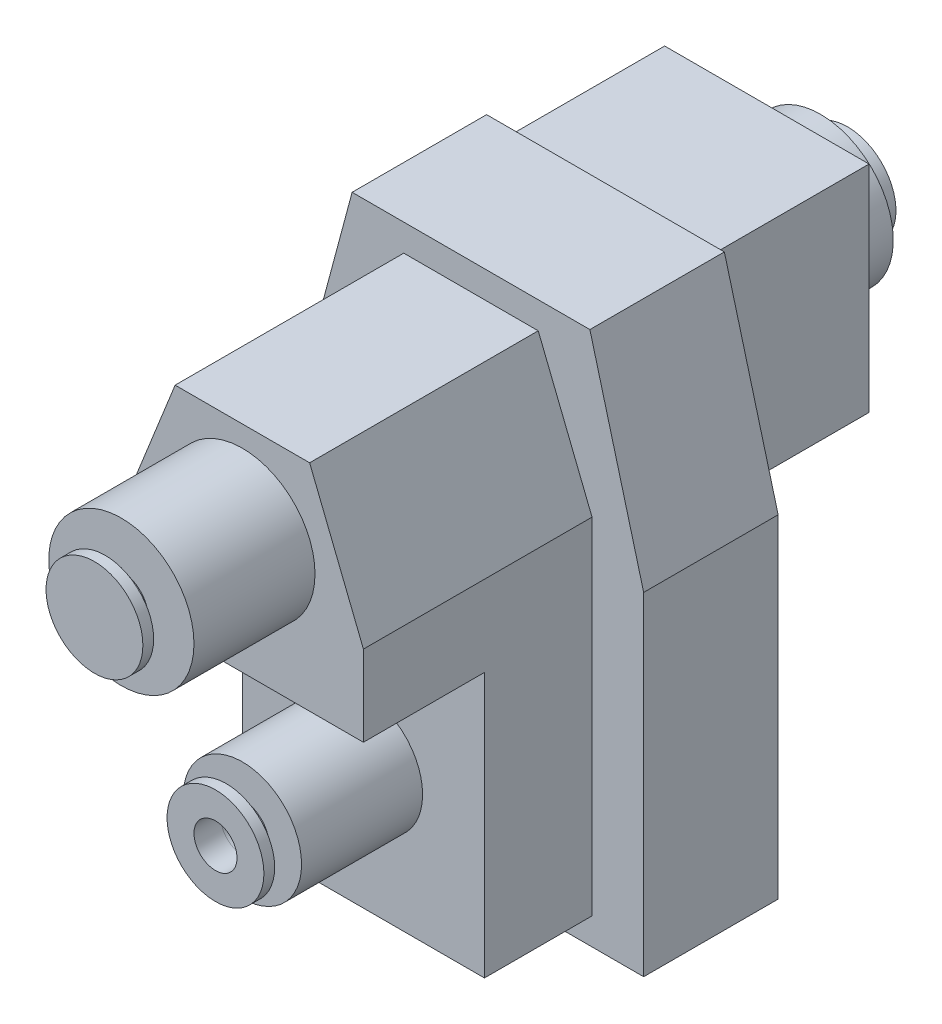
from build123d import *

# Parameters (mm, degrees)
SKETCH1_W            = 642
SKETCH1_H            = 992
BOSS_EXTRUDE1_DEPTH  = 250
CHAMFER1_SIZE        = 100
CHAMFER1_SIZE2       = 373.205080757
BOSS_EXTRUDE2_DEPTH  = 200
BOSS_EXTRUDE3_DEPTH  = 425
BOSS_EXTRUDE4_DEPTH  = 650
SKETCH3_W            = 380
SKETCH3_H            = 400
BOSS_EXTRUDE5_DEPTH  = 300
BOSS_EXTRUDE6_START  = 100
SKETCH4_R            = 135
BOSS_EXTRUDE6_DEPTH  = 100
BOSS_EXTRUDE7_START  = -340
SKETCH2_5_R          = 110
BOSS_EXTRUDE7_DEPTH  = 340
SHELL1_T             = -80
SKETCH5_W            = 642
SKETCH5_H            = 250
BOSS_EXTRUDE8_DEPTH  = 100
SKETCH6_R            = 50
BOSS_EXTRUDE9_DEPTH  = 50
BOSS_EXTRUDE10_START = 50
SKETCH6_3_R          = 90
SKETCH6_3_R_2        = 50
BOSS_EXTRUDE10_DEPTH = 20
BOSS_EXTRUDE11_START = -1300
SKETCH6_4_R          = 50
BOSS_EXTRUDE11_DEPTH = 50
BOSS_EXTRUDE12_START = -1350
SKETCH6_5_R          = 90
SKETCH6_5_R_2        = 50
BOSS_EXTRUDE12_DEPTH = 20
SKETCH7_R            = 50
BOSS_EXTRUDE13_DEPTH = 50
BOSS_EXTRUDE14_START = 50
SKETCH7_3_R          = 90
SKETCH7_3_R_2        = 50
BOSS_EXTRUDE14_DEPTH = 20
BOSS_EXTRUDE15_START = -765
SKETCH7_4_R          = 50
BOSS_EXTRUDE15_DEPTH = 50
BOSS_EXTRUDE16_START = -815
SKETCH7_5_R          = 90
SKETCH7_5_R_2        = 50
BOSS_EXTRUDE16_DEPTH = 20
SKETCH8_R            = 40
CUT_EXTRUDE1_DEPTH   = 125
CUT_EXTRUDE2_START   = -740
SKETCH8_2_R          = 40
CUT_EXTRUDE2_DEPTH   = 125


with BuildPart() as part:
    # Sketch1 → Boss-Extrude1 (new body)
    with BuildSketch(Plane.XY):
        Rectangle(SKETCH1_W, SKETCH1_H)
    extrude(amount=BOSS_EXTRUDE1_DEPTH)

    # Chamfer1
    chamfer1_edges = [part.edges().sort_by_distance(p)[0] for p in [
        (-321, 496, 125),
        (321, 496, 125),
    ]]
    chamfer1_side = [part.faces().sort_by_distance(p)[0] for p in [
        (0, 496, 125),
    ]]
    chamfer(chamfer1_edges, length=CHAMFER1_SIZE, length2=CHAMFER1_SIZE2, reference=chamfer1_side[0])

    # Sketch2 → Boss-Extrude2 (add)
    with BuildSketch(Plane.XY.offset(250)):
        with BuildLine():
            Line((0, 407), (0, 446))
            Line((0, 446), (-125, 446))
            Line((-125, 446), (-225, 196))
            Line((-225, 196), (-225, 46))
            Line((-225, 46), (0, 46))
            Line((0, 46), (0, 137))
            ThreePointArc((0, 137), (-135, 272), (0, 407))
        make_face()
        with BuildLine():
            Line((125, 446), (0, 446))
            Line((0, 446), (0, 407))
            ThreePointArc((0, 407), (95.45941546, 367.45941546), (135, 272))
            ThreePointArc((135, 272), (95.45941546, 176.54058454), (0, 137))
            Line((0, 137), (0, 46))
            Line((0, 46), (225, 46))
            Line((225, 46), (225, 196))
            Line((225, 196), (125, 446))
        make_face()
        with BuildLine():
            ThreePointArc((135, 272), (95.45941546, 367.45941546), (0, 407))
            Line((0, 407), (0, 137))
            ThreePointArc((0, 137), (95.45941546, 176.54058454), (135, 272))
        make_face()
        with BuildLine():
            Line((0, 137), (0, 407))
            ThreePointArc((0, 407), (-135, 272), (0, 137))
        make_face()
        with BuildLine():
            ThreePointArc((135, 272), (95.45941546, 367.45941546), (0, 407))
            Line((0, 407), (0, 137))
            ThreePointArc((0, 137), (95.45941546, 176.54058454), (135, 272))
        make_face()
        with BuildLine():
            Line((0, 137), (0, 407))
            ThreePointArc((0, 407), (-135, 272), (0, 137))
        make_face()
        with BuildLine():
            ThreePointArc((110, -208), (77.781745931, -130.218254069), (0, -98))
            Line((0, -98), (0, -318))
            ThreePointArc((0, -318), (77.781745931, -285.781745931), (110, -208))
        make_face()
        with BuildLine():
            Line((0, -318), (0, -98))
            ThreePointArc((0, -98), (-110, -208), (0, -318))
        make_face()
        with BuildLine():
            ThreePointArc((110, -208), (77.781745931, -130.218254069), (0, -98))
            Line((0, -98), (0, -318))
            ThreePointArc((0, -318), (77.781745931, -285.781745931), (110, -208))
        make_face()
        with BuildLine():
            Line((0, -318), (0, -98))
            ThreePointArc((0, -98), (-110, -208), (0, -318))
        make_face()
        with BuildLine():
            Line((0, -98), (0, 46))
            Line((0, 46), (-225, 46))
            Line((-225, 46), (-225, -446))
            Line((-225, -446), (0, -446))
            Line((0, -446), (0, -318))
            ThreePointArc((0, -318), (-110, -208), (0, -98))
        make_face()
        with BuildLine():
            Line((225, 46), (0, 46))
            Line((0, 46), (0, -98))
            ThreePointArc((0, -98), (77.781745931, -130.218254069), (110, -208))
            ThreePointArc((110, -208), (77.781745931, -285.781745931), (0, -318))
            Line((0, -318), (0, -446))
            Line((0, -446), (225, -446))
            Line((225, -446), (225, 46))
        make_face()
    extrude(amount=BOSS_EXTRUDE2_DEPTH)

    # Sketch2_3 → Boss-Extrude3 (add)
    with BuildSketch(Plane.XY.offset(250)):
        with BuildLine():
            Line((0, 407), (0, 446))
            Line((0, 446), (-125, 446))
            Line((-125, 446), (-225, 196))
            Line((-225, 196), (-225, 46))
            Line((-225, 46), (0, 46))
            Line((0, 46), (0, 137))
            ThreePointArc((0, 137), (-135, 272), (0, 407))
        make_face()
        with BuildLine():
            Line((125, 446), (0, 446))
            Line((0, 446), (0, 407))
            ThreePointArc((0, 407), (95.45941546, 367.45941546), (135, 272))
            ThreePointArc((135, 272), (95.45941546, 176.54058454), (0, 137))
            Line((0, 137), (0, 46))
            Line((0, 46), (225, 46))
            Line((225, 46), (225, 196))
            Line((225, 196), (125, 446))
        make_face()
        with BuildLine():
            ThreePointArc((135, 272), (95.45941546, 367.45941546), (0, 407))
            Line((0, 407), (0, 137))
            ThreePointArc((0, 137), (95.45941546, 176.54058454), (135, 272))
        make_face()
        with BuildLine():
            Line((0, 137), (0, 407))
            ThreePointArc((0, 407), (-135, 272), (0, 137))
        make_face()
        with BuildLine():
            ThreePointArc((135, 272), (95.45941546, 367.45941546), (0, 407))
            Line((0, 407), (0, 137))
            ThreePointArc((0, 137), (95.45941546, 176.54058454), (135, 272))
        make_face()
        with BuildLine():
            Line((0, 137), (0, 407))
            ThreePointArc((0, 407), (-135, 272), (0, 137))
        make_face()
        with BuildLine():
            ThreePointArc((110, -208), (77.781745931, -130.218254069), (0, -98))
            Line((0, -98), (0, -318))
            ThreePointArc((0, -318), (77.781745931, -285.781745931), (110, -208))
        make_face()
        with BuildLine():
            Line((0, -318), (0, -98))
            ThreePointArc((0, -98), (-110, -208), (0, -318))
        make_face()
        with BuildLine():
            ThreePointArc((110, -208), (77.781745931, -130.218254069), (0, -98))
            Line((0, -98), (0, -318))
            ThreePointArc((0, -318), (77.781745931, -285.781745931), (110, -208))
        make_face()
        with BuildLine():
            Line((0, -318), (0, -98))
            ThreePointArc((0, -98), (-110, -208), (0, -318))
        make_face()
    extrude(amount=BOSS_EXTRUDE3_DEPTH)

    # Sketch2_4 → Boss-Extrude4 (add)
    with BuildSketch(Plane.XY.offset(250)):
        with BuildLine():
            ThreePointArc((135, 272), (95.45941546, 367.45941546), (0, 407))
            Line((0, 407), (0, 137))
            ThreePointArc((0, 137), (95.45941546, 176.54058454), (135, 272))
        make_face()
        with BuildLine():
            Line((0, 137), (0, 407))
            ThreePointArc((0, 407), (-135, 272), (0, 137))
        make_face()
        with BuildLine():
            ThreePointArc((135, 272), (95.45941546, 367.45941546), (0, 407))
            Line((0, 407), (0, 137))
            ThreePointArc((0, 137), (95.45941546, 176.54058454), (135, 272))
        make_face()
        with BuildLine():
            Line((0, 137), (0, 407))
            ThreePointArc((0, 407), (-135, 272), (0, 137))
        make_face()
    extrude(amount=BOSS_EXTRUDE4_DEPTH)

    # Sketch3 → Boss-Extrude5 (add)
    with BuildSketch(Plane(origin=(0, 0, 0), x_dir=(-1, 0, 0), z_dir=(0, 0, -1))):
        with Locations((0, 272)):
            Rectangle(SKETCH3_W, SKETCH3_H)
    extrude(amount=BOSS_EXTRUDE5_DEPTH)

    # Sketch4 → Boss-Extrude6 (add)
    with BuildSketch(Plane(origin=(0, 0, -300), x_dir=(-1, 0, 0), z_dir=(0, 0, -1)).offset(BOSS_EXTRUDE6_START)):
        with Locations(Location((0, 272, 0), (0, 0, 180))):
            Circle(SKETCH4_R)
    extrude(amount=-BOSS_EXTRUDE6_DEPTH)

    # Sketch2_5 → Boss-Extrude7 (add)
    with BuildSketch(Plane.XY.offset(250).offset(BOSS_EXTRUDE7_START)):
        with Locations((0, -208)):
            Circle(SKETCH2_5_R)
    extrude(amount=BOSS_EXTRUDE7_DEPTH)

    # Shell1
    shell1_openings = [part.faces().sort_by_distance(p)[0] for p in [
        (0, -496, 125),
    ]]
    offset(amount=SHELL1_T, openings=shell1_openings, kind=Kind.INTERSECTION)

    # Sketch5 → Boss-Extrude8 (add)
    with BuildSketch(Plane.XZ.offset(496)):
        with Locations((0, 125)):
            Rectangle(SKETCH5_W, SKETCH5_H)
    extrude(amount=-BOSS_EXTRUDE8_DEPTH)


with BuildPart() as body_2:
    # Sketch6 → Boss-Extrude9 (new body)
    with BuildSketch(Plane.XY.offset(900)):
        with Locations((0, 272)):
            Circle(SKETCH6_R)
    extrude(amount=BOSS_EXTRUDE9_DEPTH)

    # Sketch6_3 → Boss-Extrude10 (add)
    with BuildSketch(Plane.XY.offset(900).offset(BOSS_EXTRUDE10_START)):
        with Locations((0, 272)):
            Circle(SKETCH6_3_R)
        with Locations((0, 272)):
            Circle(SKETCH6_3_R_2, mode=Mode.SUBTRACT)
    extrude(amount=-BOSS_EXTRUDE10_DEPTH)


with BuildPart() as body_3:
    # Sketch6_4 → Boss-Extrude11 (new body)
    with BuildSketch(Plane.XY.offset(900).offset(BOSS_EXTRUDE11_START)):
        with Locations(Location((0, 272, 0), (0, 0, 180))):
            Circle(SKETCH6_4_R)
    extrude(amount=-BOSS_EXTRUDE11_DEPTH)

    # Sketch6_5 → Boss-Extrude12 (add)
    with BuildSketch(Plane.XY.offset(900).offset(BOSS_EXTRUDE12_START)):
        with Locations(Location((0, 272, 0), (0, 0, 180))):
            Circle(SKETCH6_5_R)
        with Locations(Location((0, 272, 0), (0, 0, 180))):
            Circle(SKETCH6_5_R_2, mode=Mode.SUBTRACT)
    extrude(amount=BOSS_EXTRUDE12_DEPTH)


with BuildPart() as body_4:
    # Sketch7 → Boss-Extrude13 (new body)
    with BuildSketch(Plane.XY.offset(675)):
        with Locations((0, -208)):
            Circle(SKETCH7_R)
    extrude(amount=BOSS_EXTRUDE13_DEPTH)

    # Sketch7_3 → Boss-Extrude14 (add)
    with BuildSketch(Plane.XY.offset(675).offset(BOSS_EXTRUDE14_START)):
        with Locations((0, -208)):
            Circle(SKETCH7_3_R)
        with Locations((0, -208)):
            Circle(SKETCH7_3_R_2, mode=Mode.SUBTRACT)
    extrude(amount=-BOSS_EXTRUDE14_DEPTH)


with BuildPart() as body_5:
    # Sketch7_4 → Boss-Extrude15 (new body)
    with BuildSketch(Plane.XY.offset(675).offset(BOSS_EXTRUDE15_START)):
        with Locations((0, -208)):
            Circle(SKETCH7_4_R)
    extrude(amount=-BOSS_EXTRUDE15_DEPTH)

    # Sketch7_5 → Boss-Extrude16 (add)
    with BuildSketch(Plane.XY.offset(675).offset(BOSS_EXTRUDE16_START)):
        with Locations((0, -208)):
            Circle(SKETCH7_5_R)
        with Locations((0, -208)):
            Circle(SKETCH7_5_R_2, mode=Mode.SUBTRACT)
    extrude(amount=BOSS_EXTRUDE16_DEPTH)


with BuildPart() as cut_extrude1_tool:
    # Sketch8 → Cut-Extrude1 (new body)
    with BuildSketch(Plane(origin=(0, 0, -140), x_dir=(-1, 0, 0), z_dir=(0, 0, -1))):
        with Locations((0, -208)):
            Circle(SKETCH8_R)
    extrude(amount=-CUT_EXTRUDE1_DEPTH)


with BuildPart() as part_1:
    add(part.part)

    # Cut-Extrude1: cut by cut_extrude1_tool
    add(cut_extrude1_tool.part, mode=Mode.SUBTRACT)


with BuildPart() as body_5_1:
    add(body_5.part)

    # Cut-Extrude1: cut by cut_extrude1_tool
    add(cut_extrude1_tool.part, mode=Mode.SUBTRACT)


with BuildPart() as cut_extrude2_tool:
    # Sketch8_2 → Cut-Extrude2 (new body)
    with BuildSketch(Plane(origin=(0, 0, -140), x_dir=(-1, 0, 0), z_dir=(0, 0, -1)).offset(CUT_EXTRUDE2_START)):
        with Locations((0, -208)):
            Circle(SKETCH8_2_R)
    extrude(amount=-CUT_EXTRUDE2_DEPTH)


with BuildPart() as part_2:
    add(part_1.part)

    # Cut-Extrude2: cut by cut_extrude2_tool
    add(cut_extrude2_tool.part, mode=Mode.SUBTRACT)


with BuildPart() as body_4_1:
    add(body_4.part)

    # Cut-Extrude2: cut by cut_extrude2_tool
    add(cut_extrude2_tool.part, mode=Mode.SUBTRACT)


solid = Compound([body_2.part, body_3.part, body_5_1.part, part_2.part, body_4_1.part])
